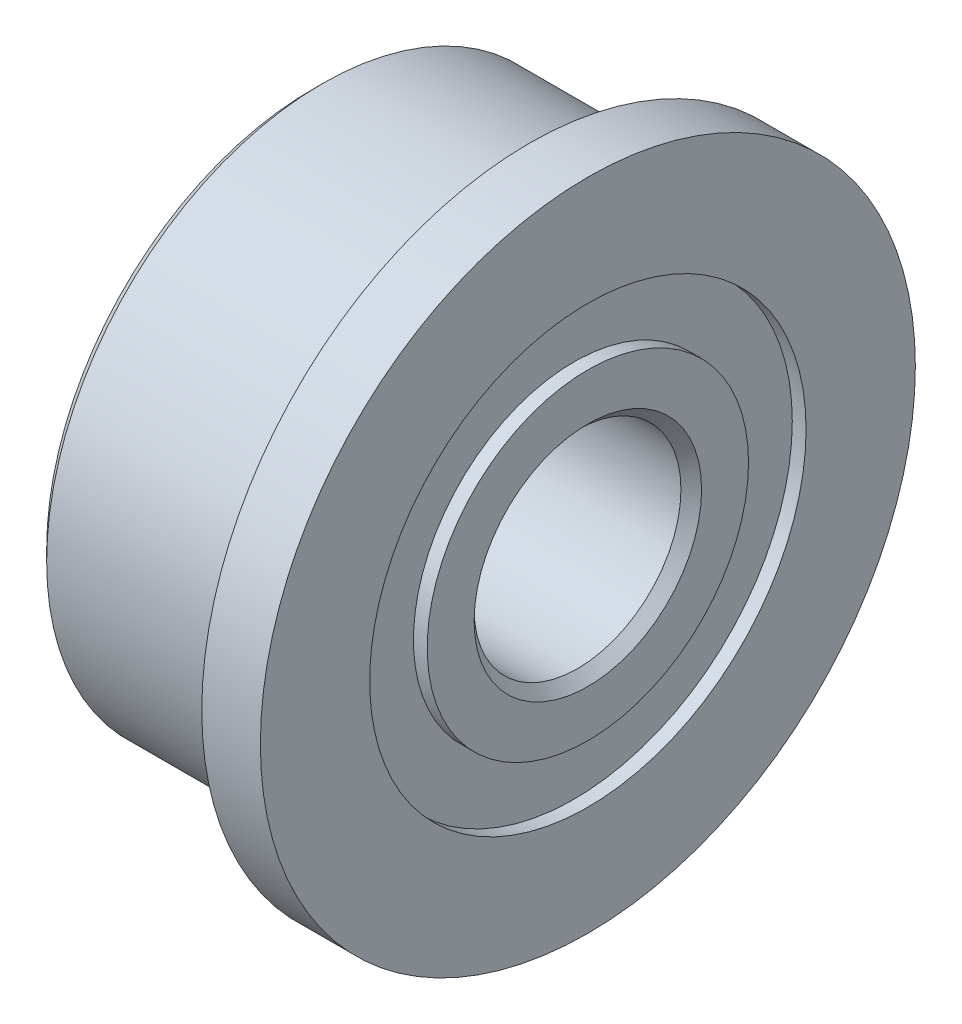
from build123d import *

# Parameters (mm, degrees)
CHAMFER1_SIZE = 0.15


with BuildPart() as part:
    # Sketch1 → Revolve1 (revolve)
    with BuildSketch(Plane.XY, mode=Mode.PRIVATE) as revolve1_sk:
        with BuildLine():
            Line((-4, 1.5), (0, 1.5))
            Line((0, 1.5), (0, 2.33))
            Line((0, 2.33), (-0.2, 2.33))
            Line((-0.2, 2.33), (-0.2, 3.165))
            Line((-0.2, 3.165), (0, 3.165))
            Line((0, 3.165), (0, 4.75))
            Line((0, 4.75), (-0.85, 4.75))
            Line((-0.85, 4.75), (-0.85, 4.02))
            ThreePointArc((-0.85, 4.02), (-0.835857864, 3.985857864), (-0.87, 4))
            Line((-0.87, 4), (-4, 4))
            Line((-4, 4), (-4, 3.165))
            Line((-4, 3.165), (-3.8, 3.165))
            Line((-3.8, 3.165), (-3.8, 2.33))
            Line((-3.8, 2.33), (-4, 2.33))
            Line((-4, 2.33), (-4, 1.5))
        make_face()
    revolve(revolve1_sk.sketch.rotate(Axis((0, 0, 0), (-1, 0, 0)), 90), axis=Axis((0, 0, 0), (-1, 0, 0)))

    # Chamfer1
    chamfer1_edges = [part.edges().sort_by_distance(p)[0] for p in [
        (-4, 0, 4),
        (0, 0, 1.5),
        (-4, 0, 1.5),
    ]]
    chamfer(chamfer1_edges, length=CHAMFER1_SIZE)


solid = part.part
